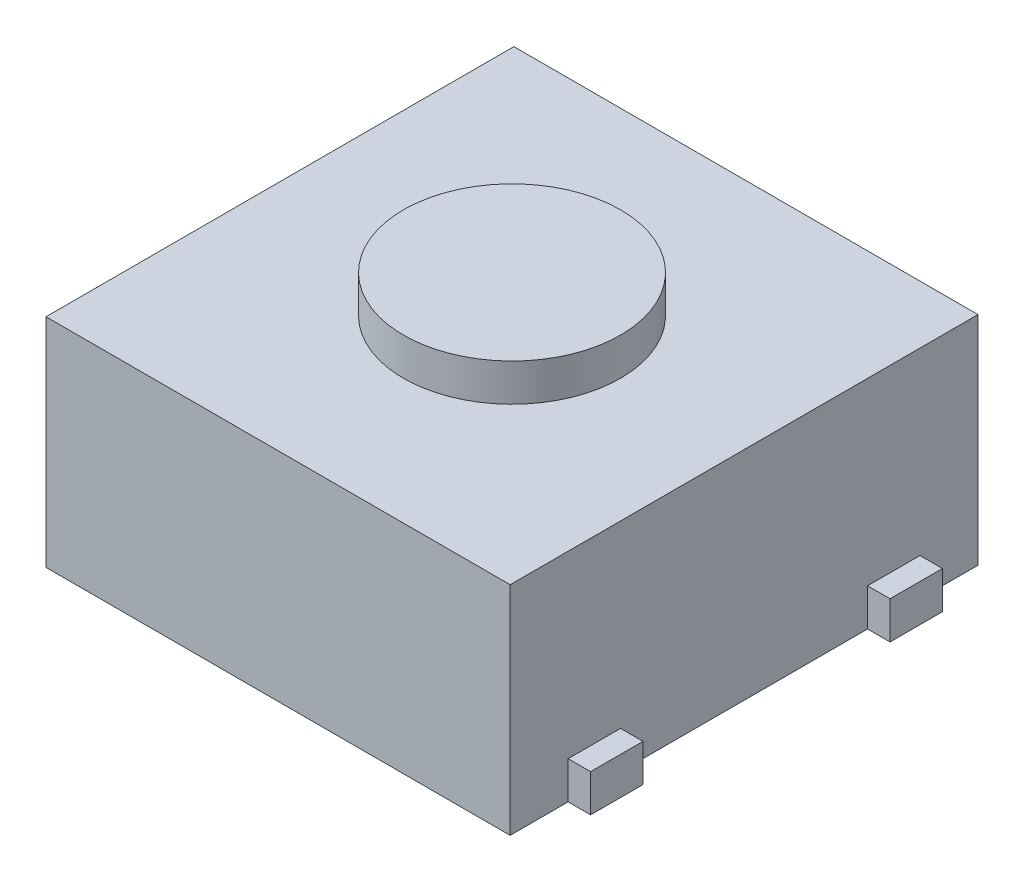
from build123d import *

# Parameters (mm, degrees)
SKETCH1_W           = 6.2
SKETCH1_H           = 6.25
BOSS_EXTRUDE1_DEPTH = 2.9
SKETCH2_W           = 0.3
SKETCH2_H           = 0.7
BOSS_EXTRUDE2_DEPTH = 0.5
SKETCH3_R           = 1.45
BOSS_EXTRUDE4_DEPTH = 0.5


with BuildPart() as part:
    # Sketch1 → Boss-Extrude1 (new body)
    with BuildSketch(Plane(origin=(0, 0, 0), x_dir=(1, 0, 0), z_dir=(0, 1, 0))):
        with Locations((3.1, 3.125)):
            Rectangle(SKETCH1_W, SKETCH1_H)
    extrude(amount=BOSS_EXTRUDE1_DEPTH)

    # Sketch2 → Boss-Extrude2 (add)
    with BuildSketch(Plane.XZ):
        with Locations((-0.15, -5.125)):
            Rectangle(SKETCH2_W, SKETCH2_H)
        with Locations((-0.15, -1.125)):
            Rectangle(SKETCH2_W, SKETCH2_H)
        with Locations((6.35, -1.125)):
            Rectangle(SKETCH2_W, SKETCH2_H)
        with Locations((6.35, -5.125)):
            Rectangle(SKETCH2_W, SKETCH2_H)
    extrude(amount=-BOSS_EXTRUDE2_DEPTH)

    # Sketch3 → Boss-Extrude4 (add)
    with BuildSketch(Plane(origin=(0, 2.9, 0), x_dir=(1, 0, 0), z_dir=(0, 1, 0))):
        with Locations(Location((3.1, 3.125, 0), (0, 0, 90))):
            Circle(SKETCH3_R)
    extrude(amount=BOSS_EXTRUDE4_DEPTH)


solid = part.part
